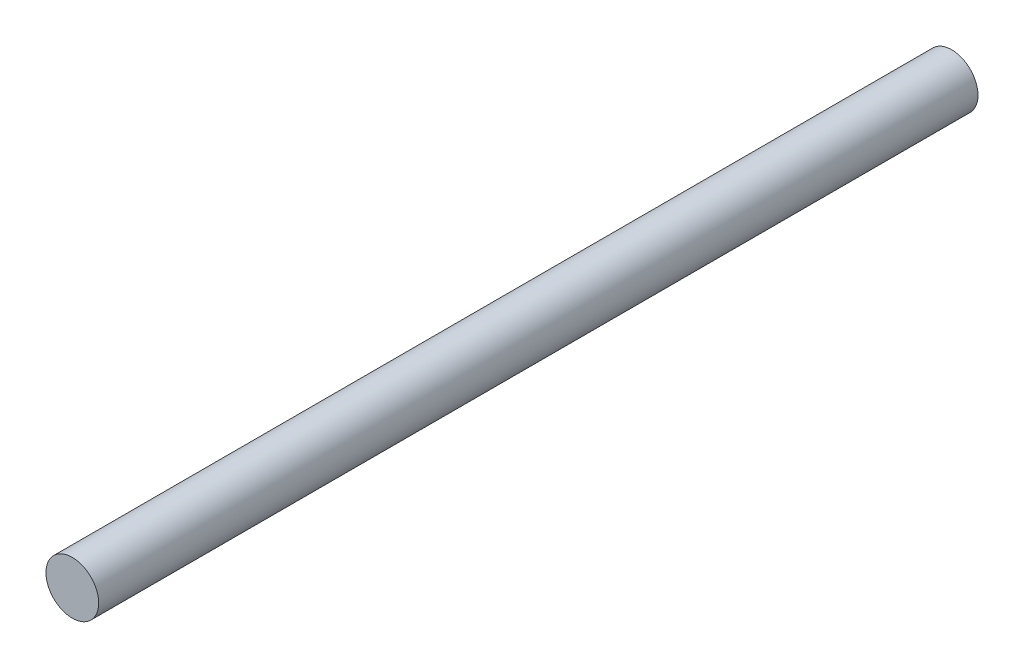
from build123d import *

# Parameters (mm, degrees)
SKETCH1_R           = 4
BOSS_EXTRUDE1_DEPTH = 133.4


with BuildPart() as part:
    # Sketch1 → Boss-Extrude1 (new body)
    with BuildSketch(Plane.XY):
        Circle(SKETCH1_R)
    extrude(amount=BOSS_EXTRUDE1_DEPTH)


solid = part.part
